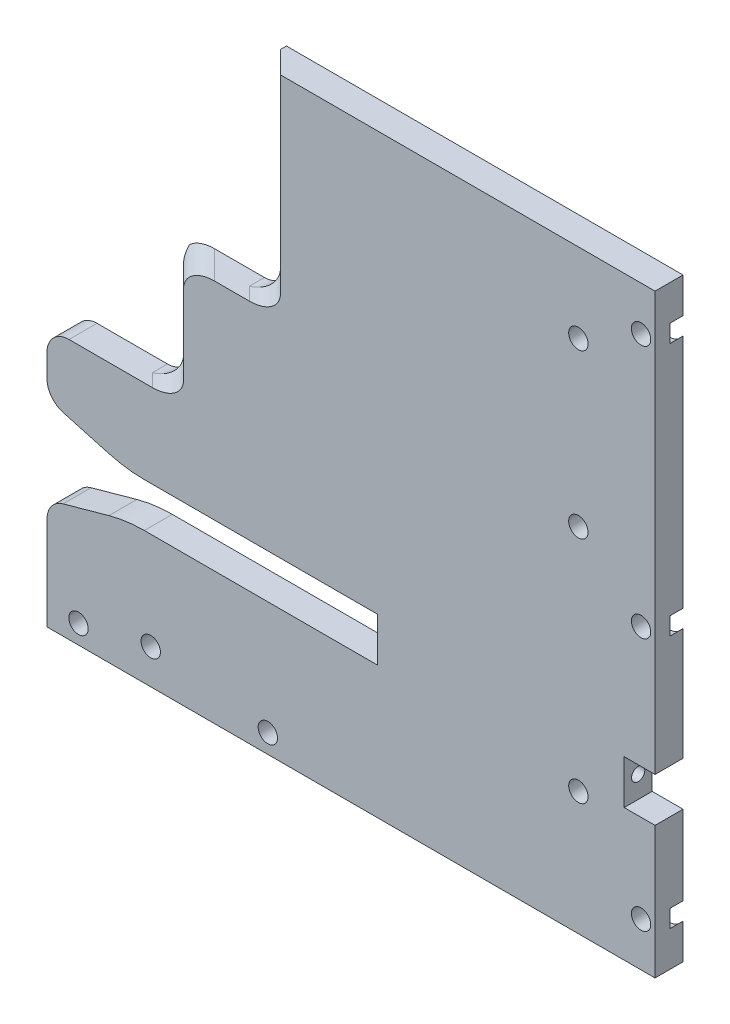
from build123d import *

# Parameters (mm, degrees)
BOSS_EXTRUDE1_DEPTH = 6.35
CUT_EXTRUDE1_DEPTH  = 194.156212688
SKETCH5_R           = 1.5
CUT_EXTRUDE2_DEPTH  = 155.564945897
FILLET1_R           = 30
CHAMFER1_SIZE       = 5
FILLET2_R           = 5
FILLET3_R           = 5
SKETCH6_W           = 7
SKETCH6_H           = 10
CUT_EXTRUDE3_DEPTH  = 194.156212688
HOLE1_D             = 4.4
HOLE1_CBORE_D       = 7.5
HOLE1_CBORE_DEPTH   = 3
HOLE2_D             = 4.4
HOLE2_CBORE_D       = 7.5
HOLE2_CBORE_DEPTH   = 3
FILLET4_R           = 5
HOLE3_D             = 4.4
HOLE3_CBORE_D       = 7.5
HOLE3_CBORE_DEPTH   = 3


with BuildPart() as part:
    # Sketch1 → Boss-Extrude1 (new body)
    with BuildSketch(Plane.XY):
        Polygon((0, 0), (-138, 0), (-138, 30), (-63, 30), (-63, 40), (-138, 40), (-138, 59), (-112, 59), (-112, 87), (-90, 87), (-90, 135), (0, 135), align=None)
    extrude(amount=BOSS_EXTRUDE1_DEPTH)

    # Sketch4 → Cut-Extrude1 (cut, through all)
    with BuildSketch(Plane(origin=(0, 0, 0), x_dir=(-1, 0, 0), z_dir=(0, 0, -1))):
        Polygon((120, 40), (138, 45), (138, 40), align=None)
        Polygon((120, 30), (138, 30), (138, 25), align=None)
    extrude(amount=-CUT_EXTRUDE1_DEPTH, mode=Mode.SUBTRACT)

    # Sketch5 → Cut-Extrude2 (cut, through all)
    with BuildSketch(Plane.ZY.offset(63)):
        with Locations((3.175, 35)):
            Circle(SKETCH5_R)
    extrude(amount=-CUT_EXTRUDE2_DEPTH, mode=Mode.SUBTRACT)

    # Fillet1
    fillet1_edges = [part.edges().sort_by_distance(p)[0] for p in [
        (-120, 40, 3.175),
        (-120, 30, 3.175),
    ]]
    fillet(fillet1_edges, radius=FILLET1_R)

    # Chamfer1
    chamfer1_edges = [part.edges().sort_by_distance(p)[0] for p in [
        (-90, 111, 6.35),
        (-112, 73, 6.35),
    ]]
    chamfer(chamfer1_edges, length=CHAMFER1_SIZE)

    # Fillet2
    fillet2_edges = [part.edges().sort_by_distance(p)[0] for p in [
        (-138, 59, 3.175),
        (-138, 45, 3.175),
        (-138, 25, 3.175),
    ]]
    fillet(fillet2_edges, radius=FILLET2_R)

    # Fillet3
    fillet3_edges = [part.edges().sort_by_distance(p)[0] for p in [
        (-112, 59, 0.675),
        (-90, 87, 0.675),
        (-109.5, 59, 3.85),
        (-87.5, 87, 3.85),
    ]]
    fillet(fillet3_edges, radius=FILLET3_R)

    # Sketch6 → Cut-Extrude3 (cut, through all)
    with BuildSketch(Plane(origin=(0, 0, 0), x_dir=(-1, 0, 0), z_dir=(0, 0, -1))):
        with Locations((3.5, 35)):
            Rectangle(SKETCH6_W, SKETCH6_H)
    extrude(amount=-CUT_EXTRUDE3_DEPTH, mode=Mode.SUBTRACT)

    # Hole1 (through all)
    with Locations(Plane(origin=(0, 0, 0), x_dir=(-1, 0, 0), z_dir=(0, 0, -1))):
        with Locations((3.175, 125), (3.175, 67.5), (3.175, 10)):
            CounterBoreHole(HOLE1_D / 2, HOLE1_CBORE_D / 2, HOLE1_CBORE_DEPTH)

    # Hole2 (through all)
    with Locations(Plane(origin=(0, 0, 0), x_dir=(-1, 0, 0), z_dir=(0, 0, -1))):
        with Locations((17.4, 117), (17.4, 80), (17.4, 28)):
            CounterBoreHole(HOLE2_D / 2, HOLE2_CBORE_D / 2, HOLE2_CBORE_DEPTH)

    # Fillet4
    fillet4_edges = [part.edges().sort_by_distance(p)[0] for p in [
        (-109.5, 87, 3.85),
    ]]
    fillet(fillet4_edges, radius=FILLET4_R)

    # Hole3 (through all)
    with Locations(Plane(origin=(0, 0, 0), x_dir=(-1, 0, 0), z_dir=(0, 0, -1))):
        with Locations((87.870353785, 4.293591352), (114.451398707, 7.906888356), (130.844995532, 4.293591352)):
            CounterBoreHole(HOLE3_D / 2, HOLE3_CBORE_D / 2, HOLE3_CBORE_DEPTH)


solid = part.part
